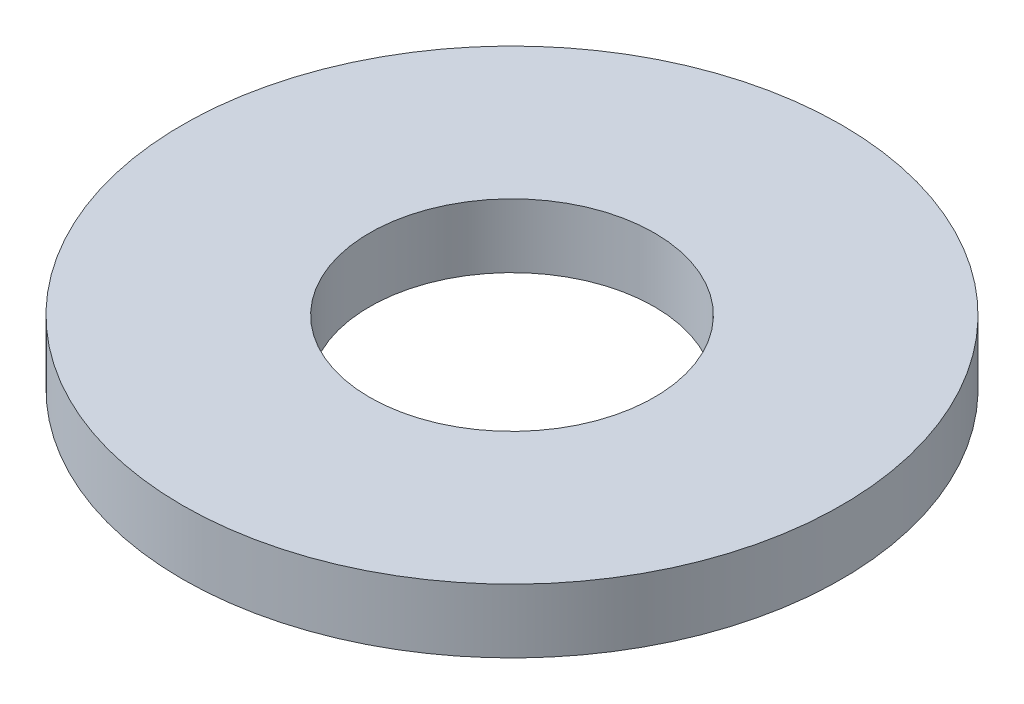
from build123d import *

# Parameters (mm, degrees)
SKETCH1_R           = 4.5847
SKETCH1_R_2         = 1.9812
BOSS_EXTRUDE1_DEPTH = 0.889


with BuildPart() as part:
    # Sketch1 → Boss-Extrude1 (new body)
    with BuildSketch(Plane(origin=(0, 0, 0), x_dir=(1, 0, 0), z_dir=(0, 1, 0))):
        with Locations(Location((0, 0, 0), (0, 0, 270))):
            Circle(SKETCH1_R)
        with Locations(Location((0, 0, 0), (0, 0, 270))):
            Circle(SKETCH1_R_2, mode=Mode.SUBTRACT)
    extrude(amount=BOSS_EXTRUDE1_DEPTH)


solid = part.part
